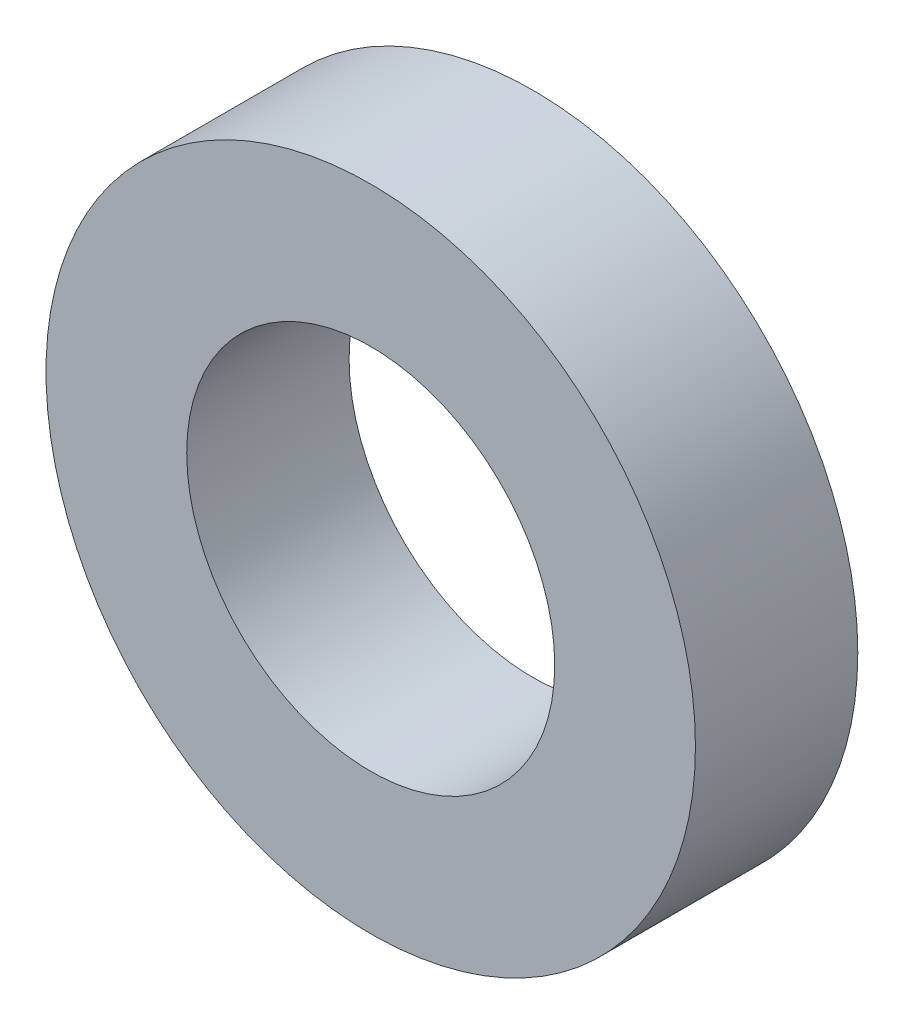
from build123d import *

# Parameters (mm, degrees)
SKETCH_1_R      = 3
SKETCH_1_R_2    = 1.7
EXTRUDE_1_DEPTH = 1.5


with BuildPart() as part:
    # Sketch 1 → Extrude 1 (new body)
    with BuildSketch(Plane.XY):
        Circle(SKETCH_1_R)
        Circle(SKETCH_1_R_2, mode=Mode.SUBTRACT)
    extrude(amount=EXTRUDE_1_DEPTH)


solid = part.part
